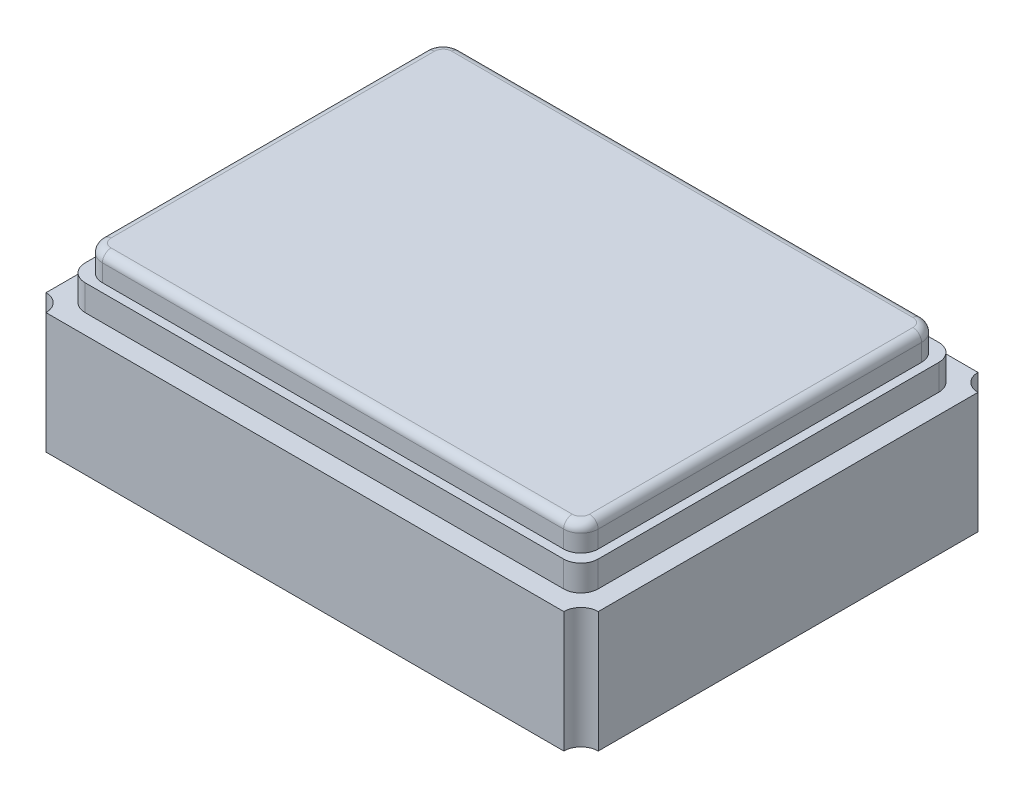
from build123d import *

# Parameters (mm, degrees)
SKETCH1_W           = 3.2
SKETCH1_H           = 2.4
BOSS_EXTRUDE1_DEPTH = 0.7
SKETCH2_R           = 0.1
CUT_EXTRUDE1_DEPTH  = 3.11896201
BOSS_EXTRUDE2_DEPTH = 0.15
BOSS_EXTRUDE3_DEPTH = 0.15
FILLET1_R           = 0.05


with BuildPart() as part:
    # Sketch1 → Boss-Extrude1 (new body)
    with BuildSketch(Plane(origin=(0, 0, 0), x_dir=(1, 0, 0), z_dir=(0, 1, 0))):
        Rectangle(SKETCH1_W, SKETCH1_H)
    extrude(amount=BOSS_EXTRUDE1_DEPTH)

    # Sketch2 → Cut-Extrude1 (cut, through all)
    with BuildSketch(Plane(origin=(0, 0.7, 0), x_dir=(1, 0, 0), z_dir=(0, 1, 0))):
        with Locations((-1.6, 1.2)):
            Circle(SKETCH2_R)
        with Locations((1.6, 1.2)):
            Circle(SKETCH2_R)
        with Locations((1.6, -1.2)):
            Circle(SKETCH2_R)
        with Locations((-1.6, -1.2)):
            Circle(SKETCH2_R)
    extrude(amount=-CUT_EXTRUDE1_DEPTH, mode=Mode.SUBTRACT)


with BuildPart() as body_2:
    # Sketch3 → Boss-Extrude2 (new body)
    with BuildSketch(Plane(origin=(0, 0.7, 0), x_dir=(1, 0, 0), z_dir=(0, 1, 0))):
        with BuildLine():
            Line((-1.386096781, -1.0868469), (1.386096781, -1.0868469))
            ThreePointArc((1.386096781, -1.0868469), (1.456807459, -1.057557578), (1.486096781, -0.9868469))
            Line((1.486096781, -0.9868469), (1.486096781, 0.9868469))
            ThreePointArc((1.486096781, 0.9868469), (1.456807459, 1.057557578), (1.386096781, 1.0868469))
            Line((1.386096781, 1.0868469), (-1.386096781, 1.0868469))
            ThreePointArc((-1.386096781, 1.0868469), (-1.456807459, 1.057557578), (-1.486096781, 0.9868469))
            Line((-1.486096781, 0.9868469), (-1.486096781, -0.9868469))
            ThreePointArc((-1.486096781, -0.9868469), (-1.456807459, -1.057557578), (-1.386096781, -1.0868469))
        make_face()
    extrude(amount=BOSS_EXTRUDE2_DEPTH)


with BuildPart() as body_3:
    # Sketch4 → Boss-Extrude3 (new body)
    with BuildSketch(Plane(origin=(0, 0.85, 0), x_dir=(1, 0, 0), z_dir=(0, 1, 0))):
        with BuildLine():
            Line((-1.336096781, -1.0368469), (1.336096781, -1.0368469))
            ThreePointArc((1.336096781, -1.0368469), (1.406807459, -1.007557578), (1.436096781, -0.9368469))
            Line((1.436096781, -0.9368469), (1.436096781, 0.9368469))
            ThreePointArc((1.436096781, 0.9368469), (1.406807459, 1.007557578), (1.336096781, 1.0368469))
            Line((1.336096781, 1.0368469), (-1.336096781, 1.0368469))
            ThreePointArc((-1.336096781, 1.0368469), (-1.406807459, 1.007557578), (-1.436096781, 0.9368469))
            Line((-1.436096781, 0.9368469), (-1.436096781, -0.9368469))
            ThreePointArc((-1.436096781, -0.9368469), (-1.406807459, -1.007557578), (-1.336096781, -1.0368469))
        make_face()
    extrude(amount=BOSS_EXTRUDE3_DEPTH)

    # Fillet1
    fillet1_edges = [body_3.edges().sort_by_distance(p)[0] for p in [
        (1.406807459, 1, 1.007557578),
        (1.436096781, 1, 0),
        (1.406807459, 1, -1.007557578),
        (0, 1, -1.0368469),
        (-1.406807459, 1, -1.007557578),
        (-1.436096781, 1, 0),
        (-1.406807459, 1, 1.007557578),
        (0, 1, 1.0368469),
    ]]
    fillet(fillet1_edges, radius=FILLET1_R)


solid = Compound([part.part, body_2.part, body_3.part])
